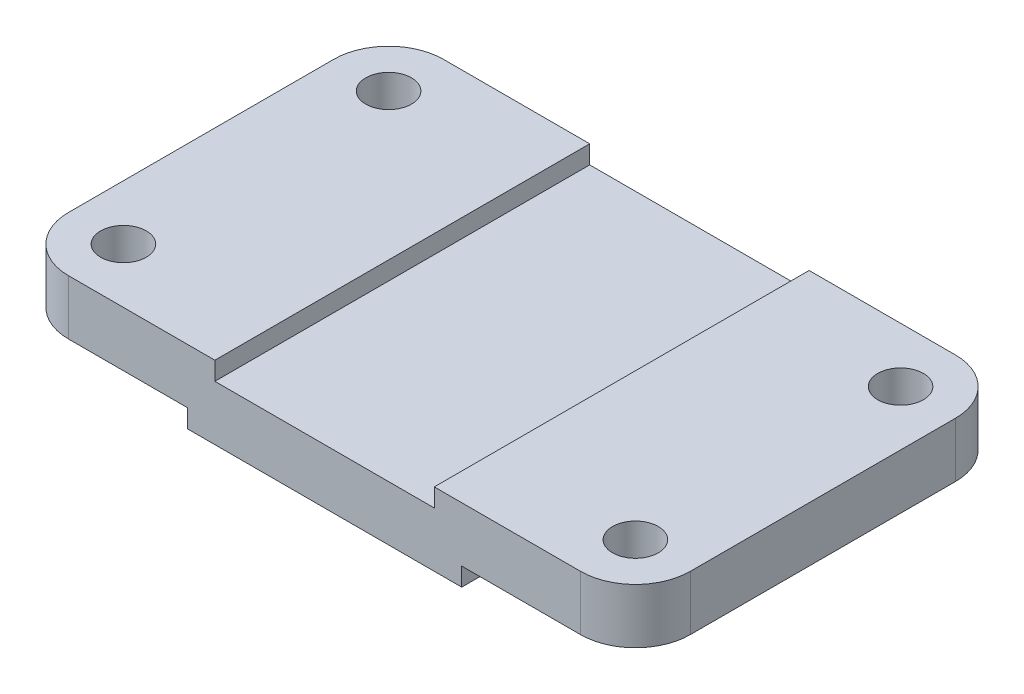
from build123d import *

# Parameters (mm, degrees)
EXTRUDE_1_DEPTH     = 41
FILLET_1_R          = 12
SKETCH_2_R          = 5
CUT_EXTRUDE_1_DEPTH = 82


with BuildPart() as part:
    # Sketch 1 → Extrude 1 (new, symmetric)
    with BuildSketch(Plane.XY):
        Polygon((-30, 0), (30, 0), (30, 4), (68, 4), (68, 16), (24, 16), (24, 12), (-24, 12), (-24, 16), (-68, 16), (-68, 4), (-30, 4), align=None)
    extrude(amount=EXTRUDE_1_DEPTH, both=True)

    # Fillet 1
    fillet_1_edges = [part.edges().sort_by_distance(p)[0] for p in [
        (68, 10, 41),
        (-68, 10, -41),
        (68, 10, -41),
        (-68, 10, 41),
    ]]
    fillet(fillet_1_edges, radius=FILLET_1_R)

    # Sketch 2 → Cut-Extrude 1 (cut, through all)
    with BuildSketch(Plane(origin=(0, 16, 0), x_dir=(-1, 0, 0), z_dir=(0, 1, 0))):
        with Locations((-56, -29)):
            Circle(SKETCH_2_R)
        with Locations((-56, 29)):
            Circle(SKETCH_2_R)
        with Locations((56, -29)):
            Circle(SKETCH_2_R)
        with Locations((56, 29)):
            Circle(SKETCH_2_R)
    extrude(amount=-CUT_EXTRUDE_1_DEPTH, mode=Mode.SUBTRACT)


solid = part.part
